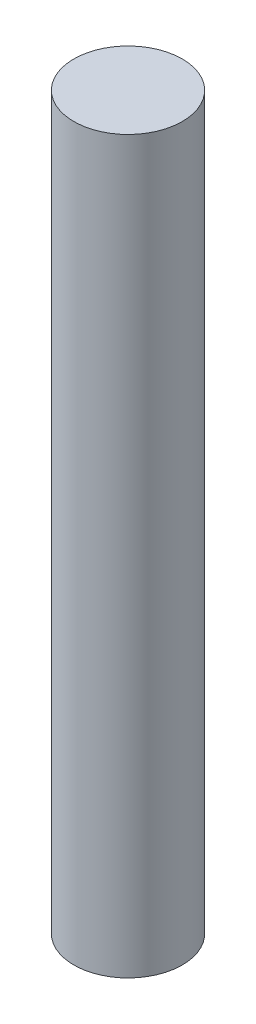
ISO-10303-21;
HEADER;
FILE_DESCRIPTION(('STEP AP214'),'2;1');
FILE_NAME('part.step','',(''),(''),'','','');
FILE_SCHEMA(('AUTOMOTIVE_DESIGN { 1 0 10303 214 1 1 1 1 }'));
ENDSEC;
DATA;
#1=APPLICATION_CONTEXT('core data for automotive mechanical design processes');
#2=APPLICATION_PROTOCOL_DEFINITION('international standard','automotive_design',2000,#1);
#3=PRODUCT_CONTEXT('',#1,'mechanical');
#4=PRODUCT('Part','Part','',(#3));
#5=PRODUCT_RELATED_PRODUCT_CATEGORY('part','',(#4));
#6=PRODUCT_DEFINITION_FORMATION('','',#4);
#7=PRODUCT_DEFINITION_CONTEXT('part definition',#1,'design');
#8=PRODUCT_DEFINITION('design','',#6,#7);
#9=PRODUCT_DEFINITION_SHAPE('','',#8);
#10=(LENGTH_UNIT() NAMED_UNIT(*) SI_UNIT(.MILLI.,.METRE.));
#11=(NAMED_UNIT(*) PLANE_ANGLE_UNIT() SI_UNIT($,.RADIAN.));
#12=(NAMED_UNIT(*) SI_UNIT($,.STERADIAN.) SOLID_ANGLE_UNIT());
#13=UNCERTAINTY_MEASURE_WITH_UNIT(LENGTH_MEASURE(1.E-05),#10,'distance_accuracy_value','');
#14=(GEOMETRIC_REPRESENTATION_CONTEXT(3) GLOBAL_UNCERTAINTY_ASSIGNED_CONTEXT((#13)) GLOBAL_UNIT_ASSIGNED_CONTEXT((#10,
#11,#12)) REPRESENTATION_CONTEXT('',''));
#15=CARTESIAN_POINT('',(0.,0.,0.));
#16=DIRECTION('',(0.,0.,1.));
#17=DIRECTION('',(1.,0.,0.));
#18=AXIS2_PLACEMENT_3D('',#15,#16,#17);
#19=CARTESIAN_POINT('',(0.,26.54,0.));
#20=DIRECTION('',(0.,-1.,0.));
#21=DIRECTION('',(0.,0.,-1.));
#22=AXIS2_PLACEMENT_3D('',#19,#20,#21);
#23=CYLINDRICAL_SURFACE('',#22,1.97);
#24=CARTESIAN_POINT('',(0.,26.54,0.));
#25=DIRECTION('',(0.,1.,0.));
#26=DIRECTION('',(0.,0.,1.));
#27=AXIS2_PLACEMENT_3D('',#24,#25,#26);
#28=CIRCLE('',#27,1.97);
#29=CARTESIAN_POINT('',(0.,26.54,-1.97));
#30=VERTEX_POINT('',#29);
#31=EDGE_CURVE('E10',#30,#30,#28,.T.);
#32=CARTESIAN_POINT('',(0.,0.,0.));
#33=DIRECTION('',(0.,1.,0.));
#34=DIRECTION('',(0.,0.,1.));
#35=AXIS2_PLACEMENT_3D('',#32,#33,#34);
#36=CIRCLE('',#35,1.97);
#37=CARTESIAN_POINT('',(0.,0.,-1.97));
#38=VERTEX_POINT('',#37);
#39=EDGE_CURVE('E48',#38,#38,#36,.T.);
#40=CARTESIAN_POINT('',(0.,26.54,-1.97));
#41=CARTESIAN_POINT('',(0.,26.2635416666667,-1.97));
#42=CARTESIAN_POINT('',(0.,25.9870833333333,-1.97));
#43=CARTESIAN_POINT('',(0.,25.4341666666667,-1.97));
#44=CARTESIAN_POINT('',(0.,25.1577083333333,-1.97));
#45=CARTESIAN_POINT('',(0.,24.6047916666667,-1.97));
#46=CARTESIAN_POINT('',(0.,24.3283333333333,-1.97));
#47=CARTESIAN_POINT('',(0.,23.7754166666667,-1.97));
#48=CARTESIAN_POINT('',(0.,23.4989583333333,-1.97));
#49=CARTESIAN_POINT('',(0.,22.9460416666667,-1.97));
#50=CARTESIAN_POINT('',(0.,22.6695833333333,-1.97));
#51=CARTESIAN_POINT('',(0.,22.1166666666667,-1.97));
#52=CARTESIAN_POINT('',(0.,21.8402083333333,-1.97));
#53=CARTESIAN_POINT('',(0.,21.2872916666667,-1.97));
#54=CARTESIAN_POINT('',(0.,21.0108333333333,-1.97));
#55=CARTESIAN_POINT('',(0.,20.4579166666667,-1.97));
#56=CARTESIAN_POINT('',(0.,20.1814583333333,-1.97));
#57=CARTESIAN_POINT('',(0.,19.6285416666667,-1.97));
#58=CARTESIAN_POINT('',(0.,19.3520833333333,-1.97));
#59=CARTESIAN_POINT('',(0.,18.7991666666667,-1.97));
#60=CARTESIAN_POINT('',(0.,18.5227083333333,-1.97));
#61=CARTESIAN_POINT('',(0.,17.9697916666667,-1.97));
#62=CARTESIAN_POINT('',(0.,17.6933333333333,-1.97));
#63=CARTESIAN_POINT('',(0.,17.1404166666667,-1.97));
#64=CARTESIAN_POINT('',(0.,16.8639583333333,-1.97));
#65=CARTESIAN_POINT('',(0.,16.3110416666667,-1.97));
#66=CARTESIAN_POINT('',(0.,16.0345833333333,-1.97));
#67=CARTESIAN_POINT('',(0.,15.4816666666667,-1.97));
#68=CARTESIAN_POINT('',(0.,15.2052083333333,-1.97));
#69=CARTESIAN_POINT('',(0.,14.6522916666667,-1.97));
#70=CARTESIAN_POINT('',(0.,14.3758333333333,-1.97));
#71=CARTESIAN_POINT('',(0.,13.8229166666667,-1.97));
#72=CARTESIAN_POINT('',(0.,13.5464583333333,-1.97));
#73=CARTESIAN_POINT('',(0.,12.9935416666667,-1.97));
#74=CARTESIAN_POINT('',(0.,12.7170833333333,-1.97));
#75=CARTESIAN_POINT('',(0.,12.1641666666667,-1.97));
#76=CARTESIAN_POINT('',(0.,11.8877083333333,-1.97));
#77=CARTESIAN_POINT('',(0.,11.3347916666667,-1.97));
#78=CARTESIAN_POINT('',(0.,11.0583333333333,-1.97));
#79=CARTESIAN_POINT('',(0.,10.5054166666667,-1.97));
#80=CARTESIAN_POINT('',(0.,10.2289583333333,-1.97));
#81=CARTESIAN_POINT('',(0.,9.67604166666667,-1.97));
#82=CARTESIAN_POINT('',(0.,9.39958333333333,-1.97));
#83=CARTESIAN_POINT('',(0.,8.84666666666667,-1.97));
#84=CARTESIAN_POINT('',(0.,8.57020833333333,-1.97));
#85=CARTESIAN_POINT('',(0.,8.01729166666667,-1.97));
#86=CARTESIAN_POINT('',(0.,7.74083333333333,-1.97));
#87=CARTESIAN_POINT('',(0.,7.18791666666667,-1.97));
#88=CARTESIAN_POINT('',(0.,6.91145833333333,-1.97));
#89=CARTESIAN_POINT('',(0.,6.35854166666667,-1.97));
#90=CARTESIAN_POINT('',(0.,6.08208333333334,-1.97));
#91=CARTESIAN_POINT('',(0.,5.52916666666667,-1.97));
#92=CARTESIAN_POINT('',(0.,5.25270833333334,-1.97));
#93=CARTESIAN_POINT('',(0.,4.69979166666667,-1.97));
#94=CARTESIAN_POINT('',(0.,4.42333333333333,-1.97));
#95=CARTESIAN_POINT('',(0.,3.87041666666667,-1.97));
#96=CARTESIAN_POINT('',(0.,3.59395833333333,-1.97));
#97=CARTESIAN_POINT('',(0.,3.04104166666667,-1.97));
#98=CARTESIAN_POINT('',(0.,2.76458333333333,-1.97));
#99=CARTESIAN_POINT('',(0.,2.21166666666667,-1.97));
#100=CARTESIAN_POINT('',(0.,1.93520833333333,-1.97));
#101=CARTESIAN_POINT('',(0.,1.38229166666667,-1.97));
#102=CARTESIAN_POINT('',(0.,1.10583333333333,-1.97));
#103=CARTESIAN_POINT('',(0.,0.552916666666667,-1.97));
#104=CARTESIAN_POINT('',(0.,0.276458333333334,-1.97));
#105=CARTESIAN_POINT('',(0.,0.,-1.97));
#106=B_SPLINE_CURVE_WITH_KNOTS('',3,(#40,#41,#42,#43,#44,#45,#46,#47,#48,#49,#50,#51,#52,#53,
#54,#55,#56,#57,#58,#59,#60,#61,#62,#63,#64,#65,#66,#67,#68,#69,#70,#71,#72,#73,#74,#75,#76,#77,
#78,#79,#80,#81,#82,#83,#84,#85,#86,#87,#88,#89,#90,#91,#92,#93,#94,#95,#96,#97,#98,#99,#100,
#101,#102,#103,#104,#105),.UNSPECIFIED.,.F.,.F.,(4,2,2,2,2,2,2,2,2,2,2,2,2,2,2,2,2,2,2,2,2,2,2,
2,2,2,2,2,2,2,2,2,4),(0.,0.829375,1.65875,2.488125,3.3175,4.146875,4.97625,5.805625,6.635,
7.464375,8.29375,9.123125,9.9525,10.781875,11.61125,12.440625,13.27,14.099375,14.92875,
15.758125,16.5875,17.416875,18.24625,19.075625,19.905,20.734375,21.56375,22.393125,23.2225,
24.051875,24.88125,25.710625,26.54),.UNSPECIFIED.);
#107=EDGE_CURVE('BSEAM45',#30,#38,#106,.T.);
#108=ORIENTED_EDGE('',*,*,#31,.F.);
#109=ORIENTED_EDGE('',*,*,#39,.T.);
#110=ORIENTED_EDGE('',*,*,#107,.T.);
#111=ORIENTED_EDGE('',*,*,#107,.F.);
#112=EDGE_LOOP('',(#108,#110,#109,#111));
#113=FACE_BOUND('',#112,.T.);
#114=ADVANCED_FACE('F45',(#113),#23,.T.);
#115=CARTESIAN_POINT('',(0.,26.54,0.));
#116=DIRECTION('',(0.,1.,0.));
#117=DIRECTION('',(0.,0.,1.));
#118=AXIS2_PLACEMENT_3D('',#115,#116,#117);
#119=PLANE('',#118);
#120=ORIENTED_EDGE('',*,*,#31,.T.);
#121=EDGE_LOOP('',(#120));
#122=FACE_BOUND('',#121,.T.);
#123=ADVANCED_FACE('F64',(#122),#119,.T.);
#124=CARTESIAN_POINT('',(0.,0.,0.));
#125=DIRECTION('',(0.,1.,0.));
#126=DIRECTION('',(0.,0.,1.));
#127=AXIS2_PLACEMENT_3D('',#124,#125,#126);
#128=PLANE('',#127);
#129=ORIENTED_EDGE('',*,*,#39,.F.);
#130=EDGE_LOOP('',(#129));
#131=FACE_BOUND('',#130,.T.);
#132=ADVANCED_FACE('F62',(#131),#128,.F.);
#133=CLOSED_SHELL('',(#114,#123,#132));
#134=MANIFOLD_SOLID_BREP('B2',#133);
#135=ADVANCED_BREP_SHAPE_REPRESENTATION('',(#18,#134),#14);
#136=SHAPE_DEFINITION_REPRESENTATION(#9,#135);
ENDSEC;
END-ISO-10303-21;
